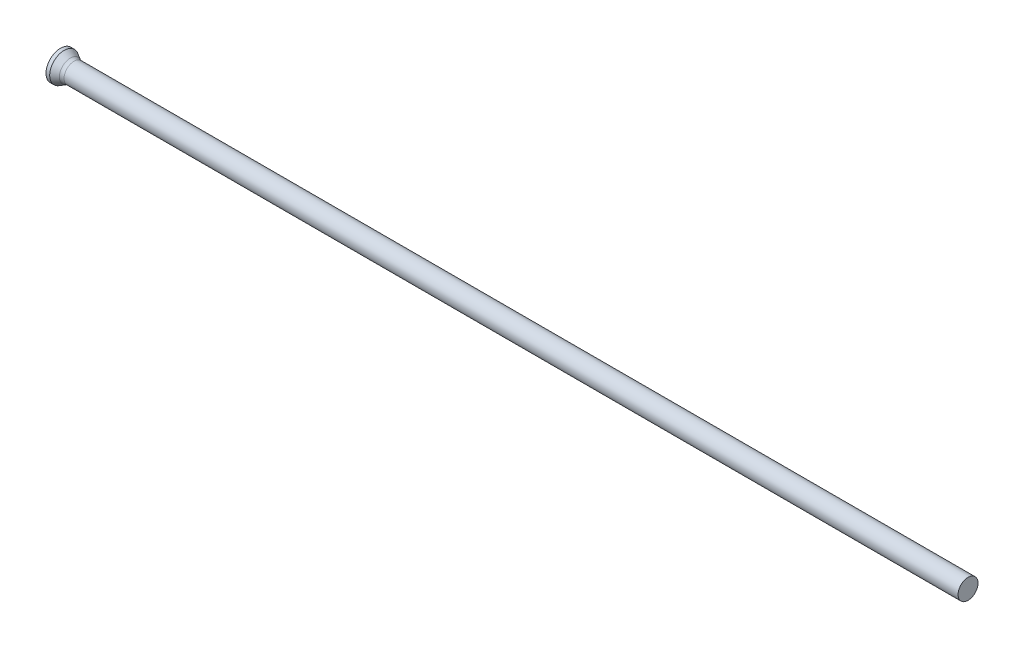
ISO-10303-21;
HEADER;
FILE_DESCRIPTION(('STEP AP214'),'2;1');
FILE_NAME('part.step','',(''),(''),'','','');
FILE_SCHEMA(('AUTOMOTIVE_DESIGN { 1 0 10303 214 1 1 1 1 }'));
ENDSEC;
DATA;
#1=APPLICATION_CONTEXT('core data for automotive mechanical design processes');
#2=APPLICATION_PROTOCOL_DEFINITION('international standard','automotive_design',2000,#1);
#3=PRODUCT_CONTEXT('',#1,'mechanical');
#4=PRODUCT('Part','Part','',(#3));
#5=PRODUCT_RELATED_PRODUCT_CATEGORY('part','',(#4));
#6=PRODUCT_DEFINITION_FORMATION('','',#4);
#7=PRODUCT_DEFINITION_CONTEXT('part definition',#1,'design');
#8=PRODUCT_DEFINITION('design','',#6,#7);
#9=PRODUCT_DEFINITION_SHAPE('','',#8);
#10=(LENGTH_UNIT() NAMED_UNIT(*) SI_UNIT(.MILLI.,.METRE.));
#11=(NAMED_UNIT(*) PLANE_ANGLE_UNIT() SI_UNIT($,.RADIAN.));
#12=(NAMED_UNIT(*) SI_UNIT($,.STERADIAN.) SOLID_ANGLE_UNIT());
#13=UNCERTAINTY_MEASURE_WITH_UNIT(LENGTH_MEASURE(1.E-05),#10,'distance_accuracy_value','');
#14=(GEOMETRIC_REPRESENTATION_CONTEXT(3) GLOBAL_UNCERTAINTY_ASSIGNED_CONTEXT((#13)) GLOBAL_UNIT_ASSIGNED_CONTEXT((#10,
#11,#12)) REPRESENTATION_CONTEXT('',''));
#15=CARTESIAN_POINT('',(0.,0.,0.));
#16=DIRECTION('',(0.,0.,1.));
#17=DIRECTION('',(1.,0.,0.));
#18=AXIS2_PLACEMENT_3D('',#15,#16,#17);
#19=CARTESIAN_POINT('',(0.,0.,0.));
#20=DIRECTION('',(1.,0.,0.));
#21=DIRECTION('',(0.,0.,-1.));
#22=AXIS2_PLACEMENT_3D('',#19,#20,#21);
#23=PLANE('',#22);
#24=CARTESIAN_POINT('',(0.,0.,0.));
#25=DIRECTION('',(-1.,0.,0.));
#26=DIRECTION('',(0.,0.,1.));
#27=AXIS2_PLACEMENT_3D('',#24,#25,#26);
#28=CIRCLE('',#27,2.);
#29=CARTESIAN_POINT('',(0.,0.,2.));
#30=VERTEX_POINT('',#29);
#31=EDGE_CURVE('E25',#30,#30,#28,.T.);
#32=ORIENTED_EDGE('',*,*,#31,.T.);
#33=EDGE_LOOP('',(#32));
#34=FACE_BOUND('',#33,.T.);
#35=ADVANCED_FACE('F14',(#34),#23,.F.);
#36=CARTESIAN_POINT('',(0.,0.,0.));
#37=DIRECTION('',(-1.,0.,0.));
#38=DIRECTION('',(0.,0.,1.));
#39=AXIS2_PLACEMENT_3D('',#36,#37,#38);
#40=CYLINDRICAL_SURFACE('',#39,2.);
#41=ORIENTED_EDGE('',*,*,#31,.F.);
#42=EDGE_LOOP('',(#41));
#43=FACE_BOUND('',#42,.T.);
#44=CARTESIAN_POINT('',(0.507468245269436,0.,0.));
#45=DIRECTION('',(-1.,0.,0.));
#46=DIRECTION('',(0.,0.,1.));
#47=AXIS2_PLACEMENT_3D('',#44,#45,#46);
#48=CIRCLE('',#47,2.);
#49=CARTESIAN_POINT('',(0.507468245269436,0.,2.));
#50=VERTEX_POINT('',#49);
#51=EDGE_CURVE('E29',#50,#50,#48,.T.);
#52=ORIENTED_EDGE('',*,*,#51,.T.);
#53=EDGE_LOOP('',(#52));
#54=FACE_BOUND('',#53,.T.);
#55=ADVANCED_FACE('F53',(#43,#54),#40,.T.);
#56=CARTESIAN_POINT('',(1.59,0.,0.));
#57=DIRECTION('',(-1.,0.,0.));
#58=DIRECTION('',(0.,0.,1.));
#59=AXIS2_PLACEMENT_3D('',#56,#57,#58);
#60=CONICAL_SURFACE('',#59,1.375,0.523598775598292);
#61=CARTESIAN_POINT('',(1.35794919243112,0.,0.));
#62=DIRECTION('',(-1.,0.,0.));
#63=DIRECTION('',(0.,0.,1.));
#64=AXIS2_PLACEMENT_3D('',#61,#62,#63);
#65=CIRCLE('',#64,1.50897459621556);
#66=CARTESIAN_POINT('',(1.35794919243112,0.,1.50897459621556));
#67=VERTEX_POINT('',#66);
#68=EDGE_CURVE('E21',#67,#67,#65,.T.);
#69=ORIENTED_EDGE('',*,*,#68,.T.);
#70=EDGE_LOOP('',(#69));
#71=FACE_BOUND('',#70,.T.);
#72=ORIENTED_EDGE('',*,*,#51,.F.);
#73=EDGE_LOOP('',(#72));
#74=FACE_BOUND('',#73,.T.);
#75=ADVANCED_FACE('F50',(#71,#74),#60,.T.);
#76=CARTESIAN_POINT('',(0.,0.,0.));
#77=DIRECTION('',(-1.,0.,0.));
#78=DIRECTION('',(0.,0.,1.));
#79=AXIS2_PLACEMENT_3D('',#76,#77,#78);
#80=CYLINDRICAL_SURFACE('',#79,1.375);
#81=CARTESIAN_POINT('',(1.85794919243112,0.,0.));
#82=DIRECTION('',(-1.,0.,0.));
#83=DIRECTION('',(0.,0.,1.));
#84=AXIS2_PLACEMENT_3D('',#81,#82,#83);
#85=CIRCLE('',#84,1.375);
#86=CARTESIAN_POINT('',(1.85794919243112,0.,1.375));
#87=VERTEX_POINT('',#86);
#88=EDGE_CURVE('E9',#87,#87,#85,.F.);
#89=ORIENTED_EDGE('',*,*,#88,.T.);
#90=EDGE_LOOP('',(#89));
#91=FACE_BOUND('',#90,.T.);
#92=CARTESIAN_POINT('',(125.,0.,0.));
#93=DIRECTION('',(-1.,0.,0.));
#94=DIRECTION('',(0.,0.,1.));
#95=AXIS2_PLACEMENT_3D('',#92,#93,#94);
#96=CIRCLE('',#95,1.375);
#97=CARTESIAN_POINT('',(125.,0.,1.375));
#98=VERTEX_POINT('',#97);
#99=EDGE_CURVE('E34',#98,#98,#96,.T.);
#100=ORIENTED_EDGE('',*,*,#99,.T.);
#101=EDGE_LOOP('',(#100));
#102=FACE_BOUND('',#101,.T.);
#103=ADVANCED_FACE('F38',(#91,#102),#80,.T.);
#104=CARTESIAN_POINT('',(125.,1.375,0.));
#105=DIRECTION('',(-1.,0.,0.));
#106=DIRECTION('',(0.,0.,1.));
#107=AXIS2_PLACEMENT_3D('',#104,#105,#106);
#108=PLANE('',#107);
#109=ORIENTED_EDGE('',*,*,#99,.F.);
#110=EDGE_LOOP('',(#109));
#111=FACE_BOUND('',#110,.T.);
#112=ADVANCED_FACE('F40',(#111),#108,.F.);
#113=CARTESIAN_POINT('',(1.85794919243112,0.,0.));
#114=DIRECTION('',(-1.,0.,0.));
#115=DIRECTION('',(0.,0.,1.));
#116=AXIS2_PLACEMENT_3D('',#113,#114,#115);
#117=TOROIDAL_SURFACE('',#116,2.375,1.);
#118=ORIENTED_EDGE('',*,*,#88,.F.);
#119=EDGE_LOOP('',(#118));
#120=FACE_BOUND('',#119,.T.);
#121=ORIENTED_EDGE('',*,*,#68,.F.);
#122=EDGE_LOOP('',(#121));
#123=FACE_BOUND('',#122,.T.);
#124=ADVANCED_FACE('F16',(#120,#123),#117,.F.);
#125=CLOSED_SHELL('',(#35,#55,#75,#103,#112,#124));
#126=MANIFOLD_SOLID_BREP('B1',#125);
#127=ADVANCED_BREP_SHAPE_REPRESENTATION('',(#18,#126),#14);
#128=SHAPE_DEFINITION_REPRESENTATION(#9,#127);
ENDSEC;
END-ISO-10303-21;
